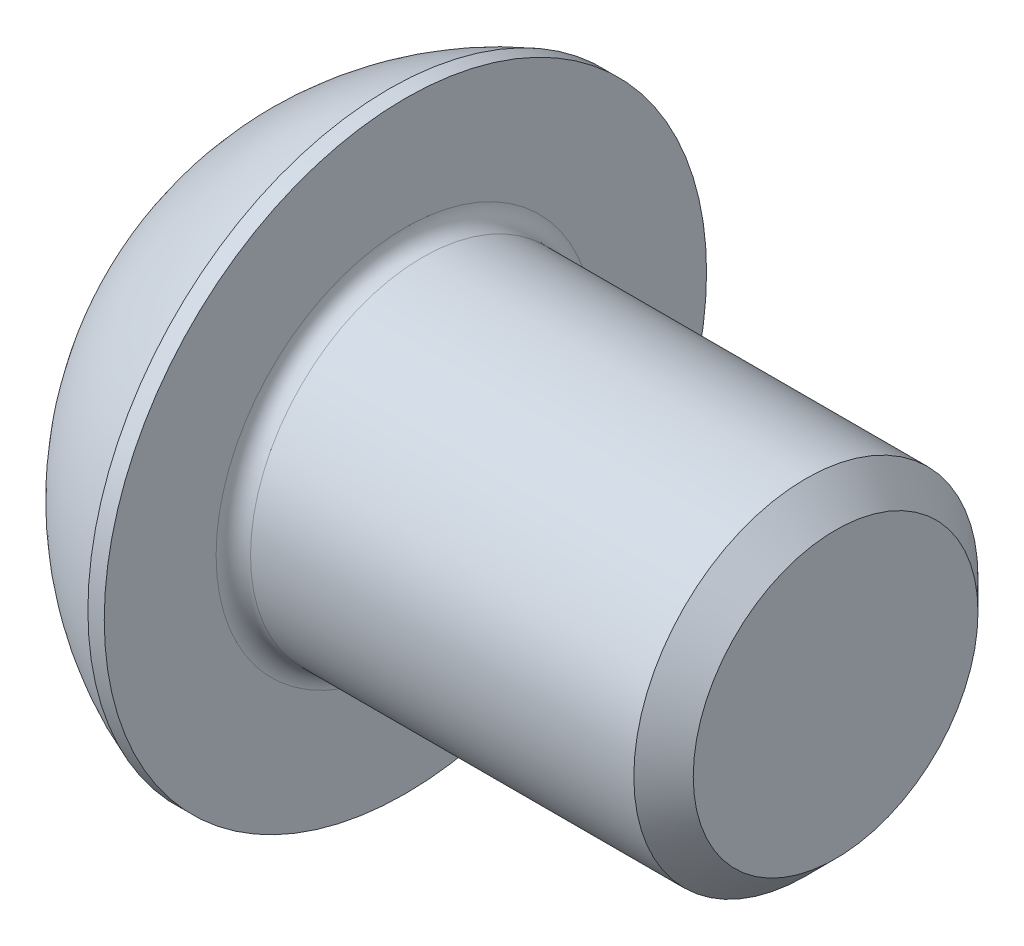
ISO-10303-21;
HEADER;
FILE_DESCRIPTION(('STEP AP214'),'2;1');
FILE_NAME('part.step','',(''),(''),'','','');
FILE_SCHEMA(('AUTOMOTIVE_DESIGN { 1 0 10303 214 1 1 1 1 }'));
ENDSEC;
DATA;
#1=APPLICATION_CONTEXT('core data for automotive mechanical design processes');
#2=APPLICATION_PROTOCOL_DEFINITION('international standard','automotive_design',2000,#1);
#3=PRODUCT_CONTEXT('',#1,'mechanical');
#4=PRODUCT('Part','Part','',(#3));
#5=PRODUCT_RELATED_PRODUCT_CATEGORY('part','',(#4));
#6=PRODUCT_DEFINITION_FORMATION('','',#4);
#7=PRODUCT_DEFINITION_CONTEXT('part definition',#1,'design');
#8=PRODUCT_DEFINITION('design','',#6,#7);
#9=PRODUCT_DEFINITION_SHAPE('','',#8);
#10=(LENGTH_UNIT() NAMED_UNIT(*) SI_UNIT(.MILLI.,.METRE.));
#11=(NAMED_UNIT(*) PLANE_ANGLE_UNIT() SI_UNIT($,.RADIAN.));
#12=(NAMED_UNIT(*) SI_UNIT($,.STERADIAN.) SOLID_ANGLE_UNIT());
#13=UNCERTAINTY_MEASURE_WITH_UNIT(LENGTH_MEASURE(1.E-05),#10,'distance_accuracy_value','');
#14=(GEOMETRIC_REPRESENTATION_CONTEXT(3) GLOBAL_UNCERTAINTY_ASSIGNED_CONTEXT((#13)) GLOBAL_UNIT_ASSIGNED_CONTEXT((#10,
#11,#12)) REPRESENTATION_CONTEXT('',''));
#15=CARTESIAN_POINT('',(0.,0.,0.));
#16=DIRECTION('',(0.,0.,1.));
#17=DIRECTION('',(1.,0.,0.));
#18=AXIS2_PLACEMENT_3D('',#15,#16,#17);
#19=CARTESIAN_POINT('',(0.,0.,0.));
#20=DIRECTION('',(-1.,0.,0.));
#21=DIRECTION('',(0.,0.,1.));
#22=AXIS2_PLACEMENT_3D('',#19,#20,#21);
#23=PLANE('',#22);
#24=CARTESIAN_POINT('',(0.,0.,0.));
#25=DIRECTION('',(-1.,0.,0.));
#26=DIRECTION('',(0.,0.,1.));
#27=AXIS2_PLACEMENT_3D('',#24,#25,#26);
#28=CIRCLE('',#27,3.5);
#29=CARTESIAN_POINT('',(0.,3.5,0.));
#30=VERTEX_POINT('',#29);
#31=EDGE_CURVE('E180',#30,#30,#28,.T.);
#32=ORIENTED_EDGE('',*,*,#31,.T.);
#33=EDGE_LOOP('',(#32));
#34=FACE_BOUND('',#33,.T.);
#35=DIRECTION('',(0.,-1.,0.));
#36=VECTOR('',#35,1.);
#37=CARTESIAN_POINT('',(0.,-1.44337567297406,2.5));
#38=LINE('',#37,#36);
#39=CARTESIAN_POINT('',(0.,1.44337567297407,2.5));
#40=VERTEX_POINT('',#39);
#41=CARTESIAN_POINT('',(0.,-1.44337567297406,2.5));
#42=VERTEX_POINT('',#41);
#43=EDGE_CURVE('E60',#40,#42,#38,.T.);
#44=ORIENTED_EDGE('',*,*,#43,.T.);
#45=DIRECTION('',(0.,-0.499999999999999,-0.866025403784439));
#46=VECTOR('',#45,1.);
#47=CARTESIAN_POINT('',(0.,-2.88675134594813,0.));
#48=LINE('',#47,#46);
#49=CARTESIAN_POINT('',(0.,-2.88675134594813,0.));
#50=VERTEX_POINT('',#49);
#51=EDGE_CURVE('E278',#42,#50,#48,.T.);
#52=ORIENTED_EDGE('',*,*,#51,.T.);
#53=DIRECTION('',(0.,0.499999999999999,-0.866025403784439));
#54=VECTOR('',#53,1.);
#55=CARTESIAN_POINT('',(0.,-1.44337567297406,-2.5));
#56=LINE('',#55,#54);
#57=CARTESIAN_POINT('',(0.,-1.44337567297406,-2.5));
#58=VERTEX_POINT('',#57);
#59=EDGE_CURVE('E147',#50,#58,#56,.T.);
#60=ORIENTED_EDGE('',*,*,#59,.T.);
#61=DIRECTION('',(0.,1.,0.));
#62=VECTOR('',#61,1.);
#63=CARTESIAN_POINT('',(0.,1.44337567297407,-2.5));
#64=LINE('',#63,#62);
#65=CARTESIAN_POINT('',(0.,1.44337567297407,-2.5));
#66=VERTEX_POINT('',#65);
#67=EDGE_CURVE('E283',#58,#66,#64,.T.);
#68=ORIENTED_EDGE('',*,*,#67,.T.);
#69=DIRECTION('',(0.,0.499999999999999,0.866025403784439));
#70=VECTOR('',#69,1.);
#71=CARTESIAN_POINT('',(0.,2.88675134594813,0.));
#72=LINE('',#71,#70);
#73=CARTESIAN_POINT('',(0.,2.88675134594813,0.));
#74=VERTEX_POINT('',#73);
#75=EDGE_CURVE('E286',#66,#74,#72,.T.);
#76=ORIENTED_EDGE('',*,*,#75,.T.);
#77=DIRECTION('',(0.,-0.499999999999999,0.866025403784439));
#78=VECTOR('',#77,1.);
#79=CARTESIAN_POINT('',(0.,1.44337567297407,2.5));
#80=LINE('',#79,#78);
#81=EDGE_CURVE('E289',#74,#40,#80,.T.);
#82=ORIENTED_EDGE('',*,*,#81,.T.);
#83=EDGE_LOOP('',(#44,#52,#60,#68,#76,#82));
#84=FACE_BOUND('',#83,.T.);
#85=ADVANCED_FACE('F44',(#34,#84),#23,.T.);
#86=CARTESIAN_POINT('',(6.58089552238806,0.,0.));
#87=DIRECTION('',(-1.,0.,0.));
#88=DIRECTION('',(0.,1.,0.));
#89=AXIS2_PLACEMENT_3D('',#86,#87,#88);
#90=SPHERICAL_SURFACE('',#89,7.45373637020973);
#91=CARTESIAN_POINT('',(4.02,0.,0.));
#92=DIRECTION('',(-1.,0.,0.));
#93=DIRECTION('',(0.,0.,1.));
#94=AXIS2_PLACEMENT_3D('',#91,#92,#93);
#95=CIRCLE('',#94,7.);
#96=CARTESIAN_POINT('',(4.02,7.,0.));
#97=VERTEX_POINT('',#96);
#98=EDGE_CURVE('E176',#97,#97,#95,.T.);
#99=CARTESIAN_POINT('',(4.02,7.,0.));
#100=CARTESIAN_POINT('',(3.96667727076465,6.98049242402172,0.));
#101=CARTESIAN_POINT('',(3.913577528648,6.96037534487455,0.));
#102=CARTESIAN_POINT('',(3.8078515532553,6.91893318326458,0.));
#103=CARTESIAN_POINT('',(3.75522531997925,6.89760810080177,0.));
#104=CARTESIAN_POINT('',(3.65047389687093,6.85376093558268,0.));
#105=CARTESIAN_POINT('',(3.59834870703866,6.83123885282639,0.));
#106=CARTESIAN_POINT('',(3.49462657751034,6.7850094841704,0.));
#107=CARTESIAN_POINT('',(3.44302963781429,6.7613021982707,0.));
#108=CARTESIAN_POINT('',(3.34039095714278,6.71271479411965,0.));
#109=CARTESIAN_POINT('',(3.28934921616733,6.6878346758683,0.));
#110=CARTESIAN_POINT('',(3.18784758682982,6.63691460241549,0.));
#111=CARTESIAN_POINT('',(3.13738769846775,6.61087464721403,0.));
#112=CARTESIAN_POINT('',(3.03707612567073,6.55764849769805,0.));
#113=CARTESIAN_POINT('',(2.98722444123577,6.53046230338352,0.));
#114=CARTESIAN_POINT('',(2.88815530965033,6.47495787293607,0.));
#115=CARTESIAN_POINT('',(2.83893786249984,6.44663963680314,0.));
#116=CARTESIAN_POINT('',(2.74116290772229,6.38888591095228,0.));
#117=CARTESIAN_POINT('',(2.69260540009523,6.35945042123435,0.));
#118=CARTESIAN_POINT('',(2.59617568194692,6.29947755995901,0.));
#119=CARTESIAN_POINT('',(2.54830347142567,6.2689401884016,0.));
#120=CARTESIAN_POINT('',(2.45326934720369,6.20677951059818,0.));
#121=CARTESIAN_POINT('',(2.40610743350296,6.17515620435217,0.));
#122=CARTESIAN_POINT('',(2.31251853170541,6.1108401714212,0.));
#123=CARTESIAN_POINT('',(2.2660915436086,6.07814744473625,0.));
#124=CARTESIAN_POINT('',(2.17399673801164,6.01170964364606,0.));
#125=CARTESIAN_POINT('',(2.12832892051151,5.97796456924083,0.));
#126=CARTESIAN_POINT('',(2.03777630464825,5.90943969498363,0.));
#127=CARTESIAN_POINT('',(1.99289150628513,5.87465989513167,0.));
#128=CARTESIAN_POINT('',(1.90392836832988,5.80408373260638,0.));
#129=CARTESIAN_POINT('',(1.85985002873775,5.76828736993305,0.));
#130=CARTESIAN_POINT('',(1.77252282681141,5.69569677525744,0.));
#131=CARTESIAN_POINT('',(1.72927396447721,5.65890254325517,0.));
#132=CARTESIAN_POINT('',(1.64362830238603,5.58433542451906,0.));
#133=CARTESIAN_POINT('',(1.60123150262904,5.54656253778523,0.));
#134=CARTESIAN_POINT('',(1.51731210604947,5.4700578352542,0.));
#135=CARTESIAN_POINT('',(1.47578950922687,5.431326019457,0.));
#136=CARTESIAN_POINT('',(1.39364020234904,5.35292368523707,0.));
#137=CARTESIAN_POINT('',(1.35301349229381,5.31325316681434,0.));
#138=CARTESIAN_POINT('',(1.27267717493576,5.23299414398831,0.));
#139=CARTESIAN_POINT('',(1.23296756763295,5.19240563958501,0.));
#140=CARTESIAN_POINT('',(1.15448619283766,5.1103318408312,0.));
#141=CARTESIAN_POINT('',(1.11571442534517,5.0688465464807,0.));
#142=CARTESIAN_POINT('',(1.03912897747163,4.98500083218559,0.));
#143=CARTESIAN_POINT('',(1.00131529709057,4.94264041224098,0.));
#144=CARTESIAN_POINT('',(0.926665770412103,4.85706656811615,0.));
#145=CARTESIAN_POINT('',(0.889829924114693,4.81385314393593,0.));
#146=CARTESIAN_POINT('',(0.817155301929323,4.72659585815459,0.));
#147=CARTESIAN_POINT('',(0.781316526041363,4.68255199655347,0.));
#148=CARTESIAN_POINT('',(0.710654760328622,4.59365683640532,0.));
#149=CARTESIAN_POINT('',(0.675831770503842,4.54880553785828,0.));
#150=CARTESIAN_POINT('',(0.607219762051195,4.45831892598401,0.));
#151=CARTESIAN_POINT('',(0.573430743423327,4.41268361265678,0.));
#152=CARTESIAN_POINT('',(0.506904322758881,4.32065280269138,0.));
#153=CARTESIAN_POINT('',(0.474166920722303,4.27425730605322,0.));
#154=CARTESIAN_POINT('',(0.409760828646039,4.18073035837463,0.));
#155=CARTESIAN_POINT('',(0.378092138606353,4.1335989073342,0.));
#156=CARTESIAN_POINT('',(0.315840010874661,4.03862466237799,0.));
#157=CARTESIAN_POINT('',(0.285256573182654,3.99078186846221,0.));
#158=CARTESIAN_POINT('',(0.2251909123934,3.89440992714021,0.));
#159=CARTESIAN_POINT('',(0.195708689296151,3.84588077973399,0.));
#160=CARTESIAN_POINT('',(0.137860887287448,3.74816145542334,0.));
#161=CARTESIAN_POINT('',(0.109495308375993,3.69897127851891,0.));
#162=CARTESIAN_POINT('',(0.0538954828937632,3.59995565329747,0.));
#163=CARTESIAN_POINT('',(0.0266612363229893,3.55013020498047,0.));
#164=CARTESIAN_POINT('',(0.,3.5,0.));
#165=B_SPLINE_CURVE_WITH_KNOTS('',3,(#99,#100,#101,#102,#103,#104,#105,#106,#107,#108,#109,#110,
#111,#112,#113,#114,#115,#116,#117,#118,#119,#120,#121,#122,#123,#124,#125,#126,#127,#128,#129,
#130,#131,#132,#133,#134,#135,#136,#137,#138,#139,#140,#141,#142,#143,#144,#145,#146,#147,#148,
#149,#150,#151,#152,#153,#154,#155,#156,#157,#158,#159,#160,#161,#162,#163,#164),.UNSPECIFIED.,
.F.,.F.,(4,2,2,2,2,2,2,2,2,2,2,2,2,2,2,2,2,2,2,2,2,2,2,2,2,2,2,2,2,2,2,2,4),(0.,
0.170333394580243,0.340666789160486,0.511000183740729,0.681333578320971,0.851666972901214,
1.02200036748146,1.1923337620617,1.36266715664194,1.53300055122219,1.70333394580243,
1.87366734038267,2.04400073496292,2.21433412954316,2.3846675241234,2.55500091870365,
2.72533431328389,2.89566770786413,3.06600110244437,3.23633449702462,3.40666789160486,
3.5770012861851,3.74733468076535,3.91766807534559,4.08800146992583,4.25833486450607,
4.42866825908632,4.59900165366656,4.7693350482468,4.93966844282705,5.11000183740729,
5.28033523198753,5.45066862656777),.UNSPECIFIED.);
#166=EDGE_CURVE('BSEAM203',#97,#30,#165,.T.);
#167=ORIENTED_EDGE('',*,*,#98,.T.);
#168=ORIENTED_EDGE('',*,*,#31,.F.);
#169=ORIENTED_EDGE('',*,*,#166,.T.);
#170=ORIENTED_EDGE('',*,*,#166,.F.);
#171=EDGE_LOOP('',(#167,#169,#168,#170));
#172=FACE_BOUND('',#171,.T.);
#173=ADVANCED_FACE('F203',(#172),#90,.T.);
#174=CARTESIAN_POINT('',(0.,0.,0.));
#175=DIRECTION('',(-1.,0.,0.));
#176=DIRECTION('',(0.,0.,1.));
#177=AXIS2_PLACEMENT_3D('',#174,#175,#176);
#178=CYLINDRICAL_SURFACE('',#177,7.);
#179=ORIENTED_EDGE('',*,*,#98,.F.);
#180=EDGE_LOOP('',(#179));
#181=FACE_BOUND('',#180,.T.);
#182=CARTESIAN_POINT('',(4.4,0.,0.));
#183=DIRECTION('',(-1.,0.,0.));
#184=DIRECTION('',(0.,0.,1.));
#185=AXIS2_PLACEMENT_3D('',#182,#183,#184);
#186=CIRCLE('',#185,7.);
#187=CARTESIAN_POINT('',(4.4,0.,7.));
#188=VERTEX_POINT('',#187);
#189=EDGE_CURVE('E172',#188,#188,#186,.T.);
#190=ORIENTED_EDGE('',*,*,#189,.T.);
#191=EDGE_LOOP('',(#190));
#192=FACE_BOUND('',#191,.T.);
#193=ADVANCED_FACE('F208',(#181,#192),#178,.T.);
#194=CARTESIAN_POINT('',(4.4,3.99999999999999,0.));
#195=DIRECTION('',(-1.,0.,0.));
#196=DIRECTION('',(0.,0.,1.));
#197=AXIS2_PLACEMENT_3D('',#194,#195,#196);
#198=PLANE('',#197);
#199=CARTESIAN_POINT('',(4.4,0.,0.));
#200=DIRECTION('',(-1.,0.,0.));
#201=DIRECTION('',(0.,0.,1.));
#202=AXIS2_PLACEMENT_3D('',#199,#200,#201);
#203=CIRCLE('',#202,4.4);
#204=CARTESIAN_POINT('',(4.4,0.,4.4));
#205=VERTEX_POINT('',#204);
#206=EDGE_CURVE('E53',#205,#205,#203,.T.);
#207=ORIENTED_EDGE('',*,*,#206,.T.);
#208=EDGE_LOOP('',(#207));
#209=FACE_BOUND('',#208,.T.);
#210=ORIENTED_EDGE('',*,*,#189,.F.);
#211=EDGE_LOOP('',(#210));
#212=FACE_BOUND('',#211,.T.);
#213=ADVANCED_FACE('F187',(#209,#212),#198,.F.);
#214=CARTESIAN_POINT('',(0.,0.,0.));
#215=DIRECTION('',(-1.,0.,0.));
#216=DIRECTION('',(0.,0.,1.));
#217=AXIS2_PLACEMENT_3D('',#214,#215,#216);
#218=CYLINDRICAL_SURFACE('',#217,4.);
#219=CARTESIAN_POINT('',(4.8,0.,0.));
#220=DIRECTION('',(-1.,0.,0.));
#221=DIRECTION('',(0.,0.,1.));
#222=AXIS2_PLACEMENT_3D('',#219,#220,#221);
#223=CIRCLE('',#222,4.);
#224=CARTESIAN_POINT('',(4.8,0.,4.));
#225=VERTEX_POINT('',#224);
#226=EDGE_CURVE('E11',#225,#225,#223,.F.);
#227=ORIENTED_EDGE('',*,*,#226,.T.);
#228=EDGE_LOOP('',(#227));
#229=FACE_BOUND('',#228,.T.);
#230=CARTESIAN_POINT('',(13.7095,0.,0.));
#231=DIRECTION('',(-1.,0.,0.));
#232=DIRECTION('',(0.,0.,1.));
#233=AXIS2_PLACEMENT_3D('',#230,#231,#232);
#234=CIRCLE('',#233,4.);
#235=CARTESIAN_POINT('',(13.7095,0.,4.));
#236=VERTEX_POINT('',#235);
#237=EDGE_CURVE('E168',#236,#236,#234,.T.);
#238=ORIENTED_EDGE('',*,*,#237,.T.);
#239=EDGE_LOOP('',(#238));
#240=FACE_BOUND('',#239,.T.);
#241=ADVANCED_FACE('F217',(#229,#240),#218,.T.);
#242=CARTESIAN_POINT('',(14.4,0.,0.));
#243=DIRECTION('',(-1.,0.,0.));
#244=DIRECTION('',(0.,0.,1.));
#245=AXIS2_PLACEMENT_3D('',#242,#243,#244);
#246=CONICAL_SURFACE('',#245,3.3095,0.785398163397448);
#247=ORIENTED_EDGE('',*,*,#237,.F.);
#248=EDGE_LOOP('',(#247));
#249=FACE_BOUND('',#248,.T.);
#250=CARTESIAN_POINT('',(14.4,0.,0.));
#251=DIRECTION('',(-1.,0.,0.));
#252=DIRECTION('',(0.,0.,1.));
#253=AXIS2_PLACEMENT_3D('',#250,#251,#252);
#254=CIRCLE('',#253,3.3095);
#255=CARTESIAN_POINT('',(14.4,0.,3.3095));
#256=VERTEX_POINT('',#255);
#257=EDGE_CURVE('E163',#256,#256,#254,.T.);
#258=ORIENTED_EDGE('',*,*,#257,.T.);
#259=EDGE_LOOP('',(#258));
#260=FACE_BOUND('',#259,.T.);
#261=ADVANCED_FACE('F198',(#249,#260),#246,.T.);
#262=CARTESIAN_POINT('',(14.4,0.,0.));
#263=DIRECTION('',(-1.,0.,0.));
#264=DIRECTION('',(0.,0.,1.));
#265=AXIS2_PLACEMENT_3D('',#262,#263,#264);
#266=PLANE('',#265);
#267=ORIENTED_EDGE('',*,*,#257,.F.);
#268=EDGE_LOOP('',(#267));
#269=FACE_BOUND('',#268,.T.);
#270=ADVANCED_FACE('F191',(#269),#266,.F.);
#271=CARTESIAN_POINT('',(4.8,0.,0.));
#272=DIRECTION('',(-1.,0.,0.));
#273=DIRECTION('',(0.,0.,1.));
#274=AXIS2_PLACEMENT_3D('',#271,#272,#273);
#275=TOROIDAL_SURFACE('',#274,4.4,0.4);
#276=ORIENTED_EDGE('',*,*,#226,.F.);
#277=EDGE_LOOP('',(#276));
#278=FACE_BOUND('',#277,.T.);
#279=ORIENTED_EDGE('',*,*,#206,.F.);
#280=EDGE_LOOP('',(#279));
#281=FACE_BOUND('',#280,.T.);
#282=ADVANCED_FACE('F46',(#278,#281),#275,.F.);
#283=CARTESIAN_POINT('',(2.6,-2.88675134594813,0.));
#284=DIRECTION('',(0.,0.866025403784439,-0.499999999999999));
#285=DIRECTION('',(0.,0.499999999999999,0.866025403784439));
#286=AXIS2_PLACEMENT_3D('',#283,#284,#285);
#287=PLANE('',#286);
#288=DIRECTION('',(0.,-0.499999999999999,-0.866025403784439));
#289=VECTOR('',#288,1.);
#290=CARTESIAN_POINT('',(2.6,-2.88675134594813,0.));
#291=LINE('',#290,#289);
#292=CARTESIAN_POINT('',(2.6,-1.44337567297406,2.5));
#293=VERTEX_POINT('',#292);
#294=CARTESIAN_POINT('',(2.6,-2.1650635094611,1.25));
#295=VERTEX_POINT('',#294);
#296=EDGE_CURVE('E128',#293,#295,#291,.T.);
#297=ORIENTED_EDGE('',*,*,#296,.T.);
#298=CARTESIAN_POINT('',(2.6,-2.88675134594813,0.));
#299=VERTEX_POINT('',#298);
#300=EDGE_CURVE('E121',#295,#299,#291,.T.);
#301=ORIENTED_EDGE('',*,*,#300,.T.);
#302=DIRECTION('',(-1.,0.,0.));
#303=VECTOR('',#302,1.);
#304=CARTESIAN_POINT('',(2.6,-2.88675134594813,0.));
#305=LINE('',#304,#303);
#306=EDGE_CURVE('E125',#299,#50,#305,.T.);
#307=ORIENTED_EDGE('',*,*,#306,.T.);
#308=ORIENTED_EDGE('',*,*,#51,.F.);
#309=DIRECTION('',(-1.,0.,0.));
#310=VECTOR('',#309,1.);
#311=CARTESIAN_POINT('',(2.6,-1.44337567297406,2.5));
#312=LINE('',#311,#310);
#313=EDGE_CURVE('E266',#293,#42,#312,.T.);
#314=ORIENTED_EDGE('',*,*,#313,.F.);
#315=EDGE_LOOP('',(#297,#301,#307,#308,#314));
#316=FACE_BOUND('',#315,.T.);
#317=ADVANCED_FACE('F123',(#316),#287,.T.);
#318=CARTESIAN_POINT('',(2.6,-1.44337567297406,-2.5));
#319=DIRECTION('',(0.,0.866025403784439,0.499999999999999));
#320=DIRECTION('',(0.,-0.499999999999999,0.866025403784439));
#321=AXIS2_PLACEMENT_3D('',#318,#319,#320);
#322=PLANE('',#321);
#323=DIRECTION('',(0.,0.499999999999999,-0.866025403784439));
#324=VECTOR('',#323,1.);
#325=CARTESIAN_POINT('',(2.6,-1.44337567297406,-2.5));
#326=LINE('',#325,#324);
#327=CARTESIAN_POINT('',(2.6,-2.1650635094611,-1.25));
#328=VERTEX_POINT('',#327);
#329=EDGE_CURVE('E134',#299,#328,#326,.T.);
#330=ORIENTED_EDGE('',*,*,#329,.T.);
#331=CARTESIAN_POINT('',(2.6,-1.44337567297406,-2.5));
#332=VERTEX_POINT('',#331);
#333=EDGE_CURVE('E142',#328,#332,#326,.T.);
#334=ORIENTED_EDGE('',*,*,#333,.T.);
#335=DIRECTION('',(-1.,0.,0.));
#336=VECTOR('',#335,1.);
#337=CARTESIAN_POINT('',(2.6,-1.44337567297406,-2.5));
#338=LINE('',#337,#336);
#339=EDGE_CURVE('E150',#332,#58,#338,.T.);
#340=ORIENTED_EDGE('',*,*,#339,.T.);
#341=ORIENTED_EDGE('',*,*,#59,.F.);
#342=ORIENTED_EDGE('',*,*,#306,.F.);
#343=EDGE_LOOP('',(#330,#334,#340,#341,#342));
#344=FACE_BOUND('',#343,.T.);
#345=ADVANCED_FACE('F145',(#344),#322,.T.);
#346=CARTESIAN_POINT('',(2.6,1.44337567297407,-2.5));
#347=DIRECTION('',(0.,0.,1.));
#348=DIRECTION('',(0.,-1.,0.));
#349=AXIS2_PLACEMENT_3D('',#346,#347,#348);
#350=PLANE('',#349);
#351=DIRECTION('',(0.,1.,0.));
#352=VECTOR('',#351,1.);
#353=CARTESIAN_POINT('',(2.6,1.44337567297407,-2.5));
#354=LINE('',#353,#352);
#355=CARTESIAN_POINT('',(2.6,0.,-2.5));
#356=VERTEX_POINT('',#355);
#357=EDGE_CURVE('E313',#332,#356,#354,.T.);
#358=ORIENTED_EDGE('',*,*,#357,.T.);
#359=CARTESIAN_POINT('',(2.6,1.44337567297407,-2.5));
#360=VERTEX_POINT('',#359);
#361=EDGE_CURVE('E141',#356,#360,#354,.T.);
#362=ORIENTED_EDGE('',*,*,#361,.T.);
#363=DIRECTION('',(-1.,0.,0.));
#364=VECTOR('',#363,1.);
#365=CARTESIAN_POINT('',(2.6,1.44337567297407,-2.5));
#366=LINE('',#365,#364);
#367=EDGE_CURVE('E157',#360,#66,#366,.T.);
#368=ORIENTED_EDGE('',*,*,#367,.T.);
#369=ORIENTED_EDGE('',*,*,#67,.F.);
#370=ORIENTED_EDGE('',*,*,#339,.F.);
#371=EDGE_LOOP('',(#358,#362,#368,#369,#370));
#372=FACE_BOUND('',#371,.T.);
#373=ADVANCED_FACE('F231',(#372),#350,.T.);
#374=CARTESIAN_POINT('',(2.6,2.88675134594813,0.));
#375=DIRECTION('',(0.,-0.866025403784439,0.499999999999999));
#376=DIRECTION('',(0.,-0.5,-0.866025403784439));
#377=AXIS2_PLACEMENT_3D('',#374,#375,#376);
#378=PLANE('',#377);
#379=DIRECTION('',(0.,0.499999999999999,0.866025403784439));
#380=VECTOR('',#379,1.);
#381=CARTESIAN_POINT('',(2.6,2.88675134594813,0.));
#382=LINE('',#381,#380);
#383=CARTESIAN_POINT('',(2.6,2.1650635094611,-1.25));
#384=VERTEX_POINT('',#383);
#385=EDGE_CURVE('E322',#360,#384,#382,.T.);
#386=ORIENTED_EDGE('',*,*,#385,.T.);
#387=CARTESIAN_POINT('',(2.6,2.88675134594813,0.));
#388=VERTEX_POINT('',#387);
#389=EDGE_CURVE('E318',#384,#388,#382,.T.);
#390=ORIENTED_EDGE('',*,*,#389,.T.);
#391=DIRECTION('',(-1.,0.,0.));
#392=VECTOR('',#391,1.);
#393=CARTESIAN_POINT('',(2.6,2.88675134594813,0.));
#394=LINE('',#393,#392);
#395=EDGE_CURVE('E297',#388,#74,#394,.T.);
#396=ORIENTED_EDGE('',*,*,#395,.T.);
#397=ORIENTED_EDGE('',*,*,#75,.F.);
#398=ORIENTED_EDGE('',*,*,#367,.F.);
#399=EDGE_LOOP('',(#386,#390,#396,#397,#398));
#400=FACE_BOUND('',#399,.T.);
#401=ADVANCED_FACE('F234',(#400),#378,.T.);
#402=CARTESIAN_POINT('',(2.6,1.44337567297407,2.5));
#403=DIRECTION('',(0.,-0.866025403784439,-0.5));
#404=DIRECTION('',(0.,0.5,-0.866025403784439));
#405=AXIS2_PLACEMENT_3D('',#402,#403,#404);
#406=PLANE('',#405);
#407=DIRECTION('',(0.,-0.499999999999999,0.866025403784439));
#408=VECTOR('',#407,1.);
#409=CARTESIAN_POINT('',(2.6,1.44337567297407,2.5));
#410=LINE('',#409,#408);
#411=CARTESIAN_POINT('',(2.6,2.1650635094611,1.25));
#412=VERTEX_POINT('',#411);
#413=EDGE_CURVE('E274',#388,#412,#410,.T.);
#414=ORIENTED_EDGE('',*,*,#413,.T.);
#415=CARTESIAN_POINT('',(2.6,1.44337567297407,2.5));
#416=VERTEX_POINT('',#415);
#417=EDGE_CURVE('E263',#412,#416,#410,.T.);
#418=ORIENTED_EDGE('',*,*,#417,.T.);
#419=DIRECTION('',(-1.,0.,0.));
#420=VECTOR('',#419,1.);
#421=CARTESIAN_POINT('',(2.6,1.44337567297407,2.5));
#422=LINE('',#421,#420);
#423=EDGE_CURVE('E272',#416,#40,#422,.T.);
#424=ORIENTED_EDGE('',*,*,#423,.T.);
#425=ORIENTED_EDGE('',*,*,#81,.F.);
#426=ORIENTED_EDGE('',*,*,#395,.F.);
#427=EDGE_LOOP('',(#414,#418,#424,#425,#426));
#428=FACE_BOUND('',#427,.T.);
#429=ADVANCED_FACE('F238',(#428),#406,.T.);
#430=CARTESIAN_POINT('',(2.6,-1.44337567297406,2.5));
#431=DIRECTION('',(0.,0.,-1.));
#432=DIRECTION('',(-1.,0.,0.));
#433=AXIS2_PLACEMENT_3D('',#430,#431,#432);
#434=PLANE('',#433);
#435=DIRECTION('',(0.,-1.,0.));
#436=VECTOR('',#435,1.);
#437=CARTESIAN_POINT('',(2.6,-1.44337567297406,2.5));
#438=LINE('',#437,#436);
#439=CARTESIAN_POINT('',(2.6,0.,2.5));
#440=VERTEX_POINT('',#439);
#441=EDGE_CURVE('E68',#416,#440,#438,.T.);
#442=ORIENTED_EDGE('',*,*,#441,.T.);
#443=EDGE_CURVE('E267',#440,#293,#438,.T.);
#444=ORIENTED_EDGE('',*,*,#443,.T.);
#445=ORIENTED_EDGE('',*,*,#313,.T.);
#446=ORIENTED_EDGE('',*,*,#43,.F.);
#447=ORIENTED_EDGE('',*,*,#423,.F.);
#448=EDGE_LOOP('',(#442,#444,#445,#446,#447));
#449=FACE_BOUND('',#448,.T.);
#450=ADVANCED_FACE('F242',(#449),#434,.T.);
#451=CARTESIAN_POINT('',(2.6,-1.44337567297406,2.5));
#452=DIRECTION('',(-1.,0.,0.));
#453=DIRECTION('',(0.,0.,1.));
#454=AXIS2_PLACEMENT_3D('',#451,#452,#453);
#455=PLANE('',#454);
#456=ORIENTED_EDGE('',*,*,#441,.F.);
#457=ORIENTED_EDGE('',*,*,#417,.F.);
#458=CARTESIAN_POINT('',(2.6,0.,0.));
#459=DIRECTION('',(-1.,0.,0.));
#460=DIRECTION('',(0.,0.,1.));
#461=AXIS2_PLACEMENT_3D('',#458,#459,#460);
#462=CIRCLE('',#461,2.5);
#463=EDGE_CURVE('E156',#440,#412,#462,.T.);
#464=ORIENTED_EDGE('',*,*,#463,.F.);
#465=EDGE_LOOP('',(#456,#457,#464));
#466=FACE_BOUND('',#465,.T.);
#467=ADVANCED_FACE('F246',(#466),#455,.T.);
#468=ORIENTED_EDGE('',*,*,#413,.F.);
#469=ORIENTED_EDGE('',*,*,#389,.F.);
#470=EDGE_CURVE('E164',#412,#384,#462,.T.);
#471=ORIENTED_EDGE('',*,*,#470,.F.);
#472=EDGE_LOOP('',(#468,#469,#471));
#473=FACE_BOUND('',#472,.T.);
#474=ADVANCED_FACE('F254',(#473),#455,.T.);
#475=ORIENTED_EDGE('',*,*,#385,.F.);
#476=ORIENTED_EDGE('',*,*,#361,.F.);
#477=EDGE_CURVE('E334',#384,#356,#462,.T.);
#478=ORIENTED_EDGE('',*,*,#477,.F.);
#479=EDGE_LOOP('',(#475,#476,#478));
#480=FACE_BOUND('',#479,.T.);
#481=ADVANCED_FACE('F259',(#480),#455,.T.);
#482=ORIENTED_EDGE('',*,*,#357,.F.);
#483=ORIENTED_EDGE('',*,*,#333,.F.);
#484=EDGE_CURVE('E316',#356,#328,#462,.T.);
#485=ORIENTED_EDGE('',*,*,#484,.F.);
#486=EDGE_LOOP('',(#482,#483,#485));
#487=FACE_BOUND('',#486,.T.);
#488=ADVANCED_FACE('F252',(#487),#455,.T.);
#489=ORIENTED_EDGE('',*,*,#329,.F.);
#490=ORIENTED_EDGE('',*,*,#300,.F.);
#491=EDGE_CURVE('E136',#328,#295,#462,.T.);
#492=ORIENTED_EDGE('',*,*,#491,.F.);
#493=EDGE_LOOP('',(#489,#490,#492));
#494=FACE_BOUND('',#493,.T.);
#495=ADVANCED_FACE('F135',(#494),#455,.T.);
#496=ORIENTED_EDGE('',*,*,#296,.F.);
#497=ORIENTED_EDGE('',*,*,#443,.F.);
#498=EDGE_CURVE('E149',#295,#440,#462,.T.);
#499=ORIENTED_EDGE('',*,*,#498,.F.);
#500=EDGE_LOOP('',(#496,#497,#499));
#501=FACE_BOUND('',#500,.T.);
#502=ADVANCED_FACE('F226',(#501),#455,.T.);
#503=CARTESIAN_POINT('',(4.04337567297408,0.,0.));
#504=DIRECTION('',(-1.,0.,0.));
#505=DIRECTION('',(0.,0.,1.));
#506=AXIS2_PLACEMENT_3D('',#503,#504,#505);
#507=CONICAL_SURFACE('',#506,0.,1.04719755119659);
#508=ORIENTED_EDGE('',*,*,#463,.T.);
#509=ORIENTED_EDGE('',*,*,#470,.T.);
#510=ORIENTED_EDGE('',*,*,#477,.T.);
#511=ORIENTED_EDGE('',*,*,#484,.T.);
#512=ORIENTED_EDGE('',*,*,#491,.T.);
#513=ORIENTED_EDGE('',*,*,#498,.T.);
#514=EDGE_LOOP('',(#508,#509,#510,#511,#512,#513));
#515=FACE_BOUND('',#514,.T.);
#516=CARTESIAN_POINT('',(4.04337567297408,0.,0.));
#517=VERTEX_POINT('',#516);
#518=VERTEX_LOOP('',#517);
#519=FACE_BOUND('',#518,.T.);
#520=ADVANCED_FACE('F224',(#515,#519),#507,.F.);
#521=CLOSED_SHELL('',(#85,#173,#193,#213,#241,#261,#270,#282,#317,#345,#373,#401,#429,#450,#467,
#474,#481,#488,#495,#502,#520));
#522=MANIFOLD_SOLID_BREP('B2',#521);
#523=ADVANCED_BREP_SHAPE_REPRESENTATION('',(#18,#522),#14);
#524=SHAPE_DEFINITION_REPRESENTATION(#9,#523);
ENDSEC;
END-ISO-10303-21;
